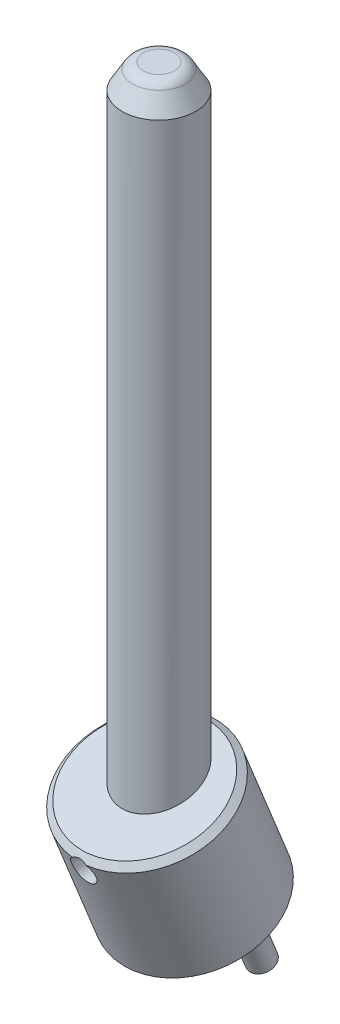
ISO-10303-21;
HEADER;
FILE_DESCRIPTION(('STEP AP214'),'2;1');
FILE_NAME('part.step','',(''),(''),'','','');
FILE_SCHEMA(('AUTOMOTIVE_DESIGN { 1 0 10303 214 1 1 1 1 }'));
ENDSEC;
DATA;
#1=APPLICATION_CONTEXT('core data for automotive mechanical design processes');
#2=APPLICATION_PROTOCOL_DEFINITION('international standard','automotive_design',2000,#1);
#3=PRODUCT_CONTEXT('',#1,'mechanical');
#4=PRODUCT('Part','Part','',(#3));
#5=PRODUCT_RELATED_PRODUCT_CATEGORY('part','',(#4));
#6=PRODUCT_DEFINITION_FORMATION('','',#4);
#7=PRODUCT_DEFINITION_CONTEXT('part definition',#1,'design');
#8=PRODUCT_DEFINITION('design','',#6,#7);
#9=PRODUCT_DEFINITION_SHAPE('','',#8);
#10=(LENGTH_UNIT() NAMED_UNIT(*) SI_UNIT(.MILLI.,.METRE.));
#11=(NAMED_UNIT(*) PLANE_ANGLE_UNIT() SI_UNIT($,.RADIAN.));
#12=(NAMED_UNIT(*) SI_UNIT($,.STERADIAN.) SOLID_ANGLE_UNIT());
#13=UNCERTAINTY_MEASURE_WITH_UNIT(LENGTH_MEASURE(1.E-05),#10,'distance_accuracy_value','');
#14=(GEOMETRIC_REPRESENTATION_CONTEXT(3) GLOBAL_UNCERTAINTY_ASSIGNED_CONTEXT((#13)) GLOBAL_UNIT_ASSIGNED_CONTEXT((#10,
#11,#12)) REPRESENTATION_CONTEXT('',''));
#15=CARTESIAN_POINT('',(0.,0.,0.));
#16=DIRECTION('',(0.,0.,1.));
#17=DIRECTION('',(1.,0.,0.));
#18=AXIS2_PLACEMENT_3D('',#15,#16,#17);
#19=CARTESIAN_POINT('',(0.,118.,0.));
#20=DIRECTION('',(0.,1.,0.));
#21=DIRECTION('',(-1.,0.,0.));
#22=AXIS2_PLACEMENT_3D('',#19,#20,#21);
#23=PLANE('',#22);
#24=CARTESIAN_POINT('',(0.,118.,-2.535898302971));
#25=CARTESIAN_POINT('',(0.0368831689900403,118.,-2.53589885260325));
#26=CARTESIAN_POINT('',(0.0737662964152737,118.,-2.53509365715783));
#27=CARTESIAN_POINT('',(0.147462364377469,118.,-2.53187572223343));
#28=CARTESIAN_POINT('',(0.18427530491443,118.,-2.52946298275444));
#29=CARTESIAN_POINT('',(0.25776089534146,118.,-2.52303390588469));
#30=CARTESIAN_POINT('',(0.294433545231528,118.,-2.51901756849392));
#31=CARTESIAN_POINT('',(0.367568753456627,118.,-2.50938911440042));
#32=CARTESIAN_POINT('',(0.404031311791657,118.,-2.50377699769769));
#33=CARTESIAN_POINT('',(0.47667692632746,118.,-2.490967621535));
#34=CARTESIAN_POINT('',(0.512859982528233,118.,-2.48377036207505));
#35=CARTESIAN_POINT('',(0.584877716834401,118.,-2.46780441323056));
#36=CARTESIAN_POINT('',(0.620712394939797,118.,-2.45903572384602));
#37=CARTESIAN_POINT('',(0.691965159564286,118.,-2.4399436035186));
#38=CARTESIAN_POINT('',(0.727383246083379,118.,-2.42962017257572));
#39=CARTESIAN_POINT('',(0.797735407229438,118.,-2.4074382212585));
#40=CARTESIAN_POINT('',(0.832669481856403,118.,-2.39557970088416));
#41=CARTESIAN_POINT('',(0.901987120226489,118.,-2.37035014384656));
#42=CARTESIAN_POINT('',(0.93637068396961,118.,-2.35697910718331));
#43=CARTESIAN_POINT('',(1.00452184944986,118.,-2.32874997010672));
#44=CARTESIAN_POINT('',(1.03828945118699,118.,-2.31389186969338));
#45=CARTESIAN_POINT('',(1.10514441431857,118.,-2.28271688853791));
#46=CARTESIAN_POINT('',(1.13823177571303,118.,-2.26640000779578));
#47=CARTESIAN_POINT('',(1.20366327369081,118.,-2.23233852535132));
#48=CARTESIAN_POINT('',(1.23600741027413,118.,-2.21459392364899));
#49=CARTESIAN_POINT('',(1.29989089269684,118.,-2.17771077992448));
#50=CARTESIAN_POINT('',(1.33143023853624,118.,-2.1585722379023));
#51=CARTESIAN_POINT('',(1.39364409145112,118.,-2.11893763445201));
#52=CARTESIAN_POINT('',(1.4243185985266,118.,-2.0984415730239));
#53=CARTESIAN_POINT('',(1.48474442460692,118.,-2.05613098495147));
#54=CARTESIAN_POINT('',(1.51449574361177,118.,-2.03431645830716));
#55=CARTESIAN_POINT('',(1.57301840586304,118.,-1.98941032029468));
#56=CARTESIAN_POINT('',(1.60178974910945,117.999999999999,-1.96631870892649));
#57=CARTESIAN_POINT('',(1.65829826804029,118.000000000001,-1.91890289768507));
#58=CARTESIAN_POINT('',(1.68603544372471,118.000000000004,-1.89457869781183));
#59=CARTESIAN_POINT('',(1.74042067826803,117.999999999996,-1.84474199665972));
#60=CARTESIAN_POINT('',(1.76706873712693,117.999999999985,-1.81922949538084));
#61=CARTESIAN_POINT('',(1.82029256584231,118.000000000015,-1.76601289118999));
#62=CARTESIAN_POINT('',(1.84682142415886,118.000000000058,-1.73826186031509));
#63=CARTESIAN_POINT('',(1.89860821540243,117.999999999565,-1.68159728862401));
#64=CARTESIAN_POINT('',(1.92386612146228,117.999999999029,-1.65268372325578));
#65=CARTESIAN_POINT('',(1.97305870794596,117.999999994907,-1.59375026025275));
#66=CARTESIAN_POINT('',(1.99699333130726,117.999999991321,-1.56373031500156));
#67=CARTESIAN_POINT('',(2.04349107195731,117.999999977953,-1.50264173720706));
#68=CARTESIAN_POINT('',(2.06605409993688,117.999999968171,-1.47157303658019));
#69=CARTESIAN_POINT('',(2.09883857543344,117.999999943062,-1.42423762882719));
#70=CARTESIAN_POINT('',(2.10959069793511,117.999999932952,-1.40833607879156));
#71=CARTESIAN_POINT('',(2.13071680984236,117.999999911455,-1.37630625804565));
#72=CARTESIAN_POINT('',(2.14109116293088,117.99999990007,-1.36017822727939));
#73=CARTESIAN_POINT('',(2.17164317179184,117.999999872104,-1.31143484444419));
#74=CARTESIAN_POINT('',(2.19125045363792,117.999999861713,-1.27845922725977));
#75=CARTESIAN_POINT('',(2.22889471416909,117.99999986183,-1.21162642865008));
#76=CARTESIAN_POINT('',(2.24693169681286,117.999999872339,-1.17776924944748));
#77=CARTESIAN_POINT('',(2.28142652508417,117.999999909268,-1.10926021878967));
#78=CARTESIAN_POINT('',(2.2978844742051,117.999999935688,-1.07460841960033));
#79=CARTESIAN_POINT('',(2.32906359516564,117.999999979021,-1.00453892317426));
#80=CARTESIAN_POINT('',(2.343784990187,117.999999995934,-0.969121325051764));
#81=CARTESIAN_POINT('',(2.36475645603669,118.000000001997,-0.915929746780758));
#82=CARTESIAN_POINT('',(2.37150562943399,118.000000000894,-0.898347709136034));
#83=CARTESIAN_POINT('',(2.39938010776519,117.999999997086,-0.823272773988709));
#84=CARTESIAN_POINT('',(2.41865194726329,117.999999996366,-0.765068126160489));
#85=CARTESIAN_POINT('',(2.44418153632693,117.999999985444,-0.677429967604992));
#86=CARTESIAN_POINT('',(2.4520654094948,117.999999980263,-0.648455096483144));
#87=CARTESIAN_POINT('',(2.4678771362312,117.999999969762,-0.585935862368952));
#88=CARTESIAN_POINT('',(2.47563936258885,117.999999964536,-0.55234891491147));
#89=CARTESIAN_POINT('',(2.48574291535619,117.999999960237,-0.504089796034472));
#90=CARTESIAN_POINT('',(2.48865470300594,117.999999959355,-0.489534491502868));
#91=CARTESIAN_POINT('',(2.49475256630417,117.999999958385,-0.457572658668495));
#92=CARTESIAN_POINT('',(2.49788384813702,117.999999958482,-0.440155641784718));
#93=CARTESIAN_POINT('',(2.50672484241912,117.999999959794,-0.387811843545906));
#94=CARTESIAN_POINT('',(2.51188215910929,117.999999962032,-0.352790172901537));
#95=CARTESIAN_POINT('',(2.52071042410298,117.999999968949,-0.282561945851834));
#96=CARTESIAN_POINT('',(2.52438140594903,117.999999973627,-0.247355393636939));
#97=CARTESIAN_POINT('',(2.53023391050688,117.999999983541,-0.176819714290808));
#98=CARTESIAN_POINT('',(2.53241549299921,117.999999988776,-0.141490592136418));
#99=CARTESIAN_POINT('',(2.53527541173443,117.999999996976,-0.0707738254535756));
#100=CARTESIAN_POINT('',(2.53595383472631,117.999999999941,-0.0353861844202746));
#101=CARTESIAN_POINT('',(2.53584271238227,118.000000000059,0.0354236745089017));
#102=CARTESIAN_POINT('',(2.5350516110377,117.999999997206,0.0708458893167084));
#103=CARTESIAN_POINT('',(2.5320340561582,117.999999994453,0.141627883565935));
#104=CARTESIAN_POINT('',(2.52980764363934,117.999999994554,0.176987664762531));
#105=CARTESIAN_POINT('',(2.52391930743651,117.99999999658,0.2475885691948));
#106=CARTESIAN_POINT('',(2.52025735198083,117.999999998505,0.28282968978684));
#107=CARTESIAN_POINT('',(2.51148466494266,118.000000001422,0.353133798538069));
#108=CARTESIAN_POINT('',(2.50637382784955,118.000000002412,0.388196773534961));
#109=CARTESIAN_POINT('',(2.49768726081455,117.999999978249,0.440622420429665));
#110=CARTESIAN_POINT('',(2.49462143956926,117.999999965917,0.458070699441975));
#111=CARTESIAN_POINT('',(2.48998637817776,117.999999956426,0.482622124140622));
#112=CARTESIAN_POINT('',(2.48860039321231,117.999999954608,0.489759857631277));
#113=CARTESIAN_POINT('',(2.4808778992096,117.999999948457,0.528551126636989));
#114=CARTESIAN_POINT('',(2.47391140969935,117.999999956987,0.56008128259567));
#115=CARTESIAN_POINT('',(2.45703811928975,117.999999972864,0.630094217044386));
#116=CARTESIAN_POINT('',(2.44682378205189,117.999999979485,0.668502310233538));
#117=CARTESIAN_POINT('',(2.42009299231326,117.999999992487,0.760237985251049));
#118=CARTESIAN_POINT('',(2.40269884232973,117.999999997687,0.81331421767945));
#119=CARTESIAN_POINT('',(2.3753299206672,117.999999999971,0.888439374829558));
#120=CARTESIAN_POINT('',(2.36674512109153,117.999999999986,0.911006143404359));
#121=CARTESIAN_POINT('',(2.34370619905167,118.000000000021,0.969129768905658));
#122=CARTESIAN_POINT('',(2.32877604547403,118.000000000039,1.00450008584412));
#123=CARTESIAN_POINT('',(2.29733862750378,117.999999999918,1.0745319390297));
#124=CARTESIAN_POINT('',(2.2808313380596,117.999999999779,1.10919346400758));
#125=CARTESIAN_POINT('',(2.24628151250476,117.999999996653,1.17774451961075));
#126=CARTESIAN_POINT('',(2.22823891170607,117.999999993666,1.2116340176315));
#127=CARTESIAN_POINT('',(2.19064875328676,117.999999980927,1.27857233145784));
#128=CARTESIAN_POINT('',(2.1711010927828,117.999999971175,1.31162108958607));
#129=CARTESIAN_POINT('',(2.14068914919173,117.999999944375,1.36051430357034));
#130=CARTESIAN_POINT('',(2.13036938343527,117.999999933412,1.37669975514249));
#131=CARTESIAN_POINT('',(2.10937145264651,117.999999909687,1.40881381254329));
#132=CARTESIAN_POINT('',(2.09869365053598,117.999999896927,1.42474265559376));
#133=CARTESIAN_POINT('',(2.06610220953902,117.999999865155,1.4721471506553));
#134=CARTESIAN_POINT('',(2.04362999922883,117.999999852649,1.50324163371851));
#135=CARTESIAN_POINT('',(1.99724968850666,117.999999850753,1.56433741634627));
#136=CARTESIAN_POINT('',(1.9733415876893,117.999999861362,1.59433871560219));
#137=CARTESIAN_POINT('',(1.92416676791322,117.999999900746,1.65320597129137));
#138=CARTESIAN_POINT('',(1.89890013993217,117.99999992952,1.68207200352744));
#139=CARTESIAN_POINT('',(1.846969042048,117.999999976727,1.73850865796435));
#140=CARTESIAN_POINT('',(1.82030475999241,117.999999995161,1.76607945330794));
#141=CARTESIAN_POINT('',(1.77844405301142,118.000000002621,1.80781306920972));
#142=CARTESIAN_POINT('',(1.76359360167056,118.000000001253,1.82232876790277));
#143=CARTESIAN_POINT('',(1.70076531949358,117.999999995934,1.88227042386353));
#144=CARTESIAN_POINT('',(1.65118456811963,117.999999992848,1.92605591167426));
#145=CARTESIAN_POINT('',(1.57488305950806,117.999999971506,1.98829577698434));
#146=CARTESIAN_POINT('',(1.549391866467,117.999999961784,2.00828584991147));
#147=CARTESIAN_POINT('',(1.49369878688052,117.999999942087,2.0502411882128));
#148=CARTESIAN_POINT('',(1.46337191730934,117.999999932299,2.0720420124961));
#149=CARTESIAN_POINT('',(1.41924056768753,117.999999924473,2.10228129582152));
#150=CARTESIAN_POINT('',(1.40582015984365,117.99999992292,2.11128589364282));
#151=CARTESIAN_POINT('',(1.37628726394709,117.999999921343,2.13068691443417));
#152=CARTESIAN_POINT('',(1.36013949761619,117.999999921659,2.14102971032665));
#153=CARTESIAN_POINT('',(1.31134785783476,117.999999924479,2.1714986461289));
#154=CARTESIAN_POINT('',(1.27835328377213,117.999999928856,2.19106696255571));
#155=CARTESIAN_POINT('',(1.21150291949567,117.999999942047,2.22866697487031));
#156=CARTESIAN_POINT('',(1.17764715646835,117.999999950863,2.2466987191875));
#157=CARTESIAN_POINT('',(1.10914688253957,117.999999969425,2.28119222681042));
#158=CARTESIAN_POINT('',(1.07450241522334,117.999999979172,2.29765407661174));
#159=CARTESIAN_POINT('',(1.00449363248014,117.999999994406,2.3289604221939));
#160=CARTESIAN_POINT('',(0.969129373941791,117.999999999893,2.34380504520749));
#161=CARTESIAN_POINT('',(0.900489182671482,118.000000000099,2.37082263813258));
#162=CARTESIAN_POINT('',(0.867259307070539,117.999999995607,2.38311297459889));
#163=CARTESIAN_POINT('',(0.800333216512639,117.999999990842,2.40634607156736));
#164=CARTESIAN_POINT('',(0.766637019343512,117.99999999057,2.41728888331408));
#165=CARTESIAN_POINT('',(0.698829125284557,117.999999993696,2.43780460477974));
#166=CARTESIAN_POINT('',(0.664717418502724,117.999999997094,2.44737748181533));
#167=CARTESIAN_POINT('',(0.596126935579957,118.00000000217,2.46511836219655));
#168=CARTESIAN_POINT('',(0.561648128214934,118.000000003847,2.47328624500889));
#169=CARTESIAN_POINT('',(0.515953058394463,117.999999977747,2.48318600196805));
#170=CARTESIAN_POINT('',(0.504864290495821,117.999999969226,2.48551693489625));
#171=CARTESIAN_POINT('',(0.482616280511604,117.999999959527,2.4899893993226));
#172=CARTESIAN_POINT('',(0.471456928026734,117.999999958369,2.49213038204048));
#173=CARTESIAN_POINT('',(0.423172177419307,117.99999995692,2.50104303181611));
#174=CARTESIAN_POINT('',(0.385898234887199,117.999999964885,2.50702838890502));
#175=CARTESIAN_POINT('',(0.321772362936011,117.999999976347,2.51585848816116));
#176=CARTESIAN_POINT('',(0.294975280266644,117.99999998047,2.51911220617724));
#177=CARTESIAN_POINT('',(0.239190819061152,117.999999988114,2.52498123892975));
#178=CARTESIAN_POINT('',(0.210196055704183,117.999999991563,2.52752671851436));
#179=CARTESIAN_POINT('',(0.14428351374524,117.999999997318,2.53217246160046));
#180=CARTESIAN_POINT('',(0.107343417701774,117.999999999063,2.53396620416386));
#181=CARTESIAN_POINT('',(0.0598216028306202,117.999999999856,2.53524043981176));
#182=CARTESIAN_POINT('',(0.0492560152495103,117.999999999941,2.53545811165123));
#183=CARTESIAN_POINT('',(0.0257940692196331,118.000000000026,2.53580073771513));
#184=CARTESIAN_POINT('',(0.0128972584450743,118.000000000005,2.53589468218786));
#185=CARTESIAN_POINT('',(0.,118.,2.535898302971));
#186=B_SPLINE_CURVE_WITH_KNOTS('',3,(#24,#25,#26,#27,#28,#29,#30,#31,#32,#33,#34,#35,#36,#37,
#38,#39,#40,#41,#42,#43,#44,#45,#46,#47,#48,#49,#50,#51,#52,#53,#54,#55,#56,#57,#58,#59,#60,#61,
#62,#63,#64,#65,#66,#67,#68,#69,#70,#71,#72,#73,#74,#75,#76,#77,#78,#79,#80,#81,#82,#83,#84,#85,
#86,#87,#88,#89,#90,#91,#92,#93,#94,#95,#96,#97,#98,#99,#100,#101,#102,#103,#104,#105,#106,#107,
#108,#109,#110,#111,#112,#113,#114,#115,#116,#117,#118,#119,#120,#121,#122,#123,#124,#125,#126,
#127,#128,#129,#130,#131,#132,#133,#134,#135,#136,#137,#138,#139,#140,#141,#142,#143,#144,#145,
#146,#147,#148,#149,#150,#151,#152,#153,#154,#155,#156,#157,#158,#159,#160,#161,#162,#163,#164,
#165,#166,#167,#168,#169,#170,#171,#172,#173,#174,#175,#176,#177,#178,#179,#180,#181,#182,#183,
#184,#185),.UNSPECIFIED.,.F.,.F.,(4,2,2,2,2,2,2,2,2,2,2,2,2,2,2,2,2,2,2,2,2,2,2,2,2,2,2,2,2,2,2,
2,2,2,2,2,2,2,2,2,2,2,2,2,2,2,2,2,2,2,2,2,2,2,2,2,2,2,2,2,2,2,2,2,2,2,2,2,2,2,2,2,2,2,2,2,2,2,2,
2,4),(0.,0.110640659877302,0.221281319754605,0.331921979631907,0.44256263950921,
0.553203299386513,0.663843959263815,0.774484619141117,0.88512527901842,0.995765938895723,
1.10640659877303,1.21704725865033,1.32768791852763,1.43832857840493,1.54896923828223,
1.65960989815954,1.77025055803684,1.88089121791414,1.99153187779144,2.10666707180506,
2.22180469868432,2.3369472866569,2.45209736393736,2.50967963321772,2.56720491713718,
2.68225192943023,2.7972986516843,2.91233782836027,3.02736220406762,3.08386093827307,
3.2675950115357,3.35766741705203,3.46104880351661,3.50557818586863,3.55866337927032,
3.66482720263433,3.7709886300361,3.87714579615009,3.98329683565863,4.08956033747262,
4.19582080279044,4.30208362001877,4.40835417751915,4.46149679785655,4.48330970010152,
4.58015247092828,4.69934377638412,4.86676228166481,4.93919015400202,5.05432496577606,
5.16946160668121,5.28460310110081,5.39975247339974,5.45733467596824,5.51486017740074,
5.6299081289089,5.7449561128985,5.85999640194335,5.97502126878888,6.03731998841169,
6.23550765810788,6.33267537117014,6.44467915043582,6.49316104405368,6.55068486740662,
6.66572392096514,6.78075934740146,6.89578843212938,7.01080846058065,7.11706929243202,
7.22332608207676,7.32958540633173,7.43585384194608,7.46984614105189,7.5039336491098,
7.61714190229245,7.69811150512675,7.78541397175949,7.89632392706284,7.92802695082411,
7.96671751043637),.UNSPECIFIED.);
#187=CARTESIAN_POINT('',(0.,118.,-2.5358983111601));
#188=VERTEX_POINT('',#187);
#189=CARTESIAN_POINT('',(0.,118.,2.5358983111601));
#190=VERTEX_POINT('',#189);
#191=EDGE_CURVE('P0_E38',#188,#190,#186,.T.);
#192=ORIENTED_EDGE('',*,*,#191,.F.);
#193=CARTESIAN_POINT('',(0.,118.,0.));
#194=DIRECTION('',(0.,-1.,0.));
#195=DIRECTION('',(0.,0.,1.));
#196=AXIS2_PLACEMENT_3D('',#193,#194,#195);
#197=CIRCLE('',#196,2.535898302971);
#198=EDGE_CURVE('P0_E42',#190,#188,#197,.T.);
#199=ORIENTED_EDGE('',*,*,#198,.F.);
#200=EDGE_LOOP('',(#192,#199));
#201=FACE_BOUND('',#200,.T.);
#202=ADVANCED_FACE('P0_F17',(#201),#23,.T.);
#203=CARTESIAN_POINT('',(0.,116.,0.));
#204=DIRECTION('',(0.,1.,0.));
#205=DIRECTION('',(0.0152566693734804,0.,0.999883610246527));
#206=AXIS2_PLACEMENT_3D('',#203,#204,#205);
#207=TOROIDAL_SURFACE('',#206,2.535898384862,2.);
#208=ORIENTED_EDGE('',*,*,#191,.T.);
#209=ORIENTED_EDGE('',*,*,#198,.T.);
#210=EDGE_LOOP('',(#208,#209));
#211=FACE_BOUND('',#210,.T.);
#212=CARTESIAN_POINT('',(0.,117.000000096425,0.));
#213=DIRECTION('',(0.,-1.,0.));
#214=DIRECTION('',(0.,0.,1.));
#215=AXIS2_PLACEMENT_3D('',#212,#213,#214);
#216=CIRCLE('',#215,4.26794913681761);
#217=CARTESIAN_POINT('',(0.,117.000000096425,4.26794913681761));
#218=VERTEX_POINT('',#217);
#219=EDGE_CURVE('P0_E48',#218,#218,#216,.T.);
#220=ORIENTED_EDGE('',*,*,#219,.F.);
#221=EDGE_LOOP('',(#220));
#222=FACE_BOUND('',#221,.T.);
#223=ADVANCED_FACE('P0_F40',(#211,#222),#207,.T.);
#224=CARTESIAN_POINT('',(0.,0.,0.));
#225=DIRECTION('',(0.,1.,0.));
#226=DIRECTION('',(-1.,0.,0.));
#227=AXIS2_PLACEMENT_3D('',#224,#225,#226);
#228=PLANE('',#227);
#229=CARTESIAN_POINT('',(0.,-2.00088834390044E-08,0.));
#230=DIRECTION('',(0.,1.,0.));
#231=DIRECTION('',(-1.,0.,0.));
#232=AXIS2_PLACEMENT_3D('',#229,#230,#231);
#233=CIRCLE('',#232,4.99999913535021);
#234=CARTESIAN_POINT('',(-4.99999913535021,-2.00088834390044E-08,0.));
#235=VERTEX_POINT('',#234);
#236=EDGE_CURVE('P0_E85',#235,#235,#233,.T.);
#237=ORIENTED_EDGE('',*,*,#236,.F.);
#238=EDGE_LOOP('',(#237));
#239=FACE_BOUND('',#238,.T.);
#240=ADVANCED_FACE('P0_F76',(#239),#228,.F.);
#241=CARTESIAN_POINT('',(0.,10.,2.15470053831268));
#242=DIRECTION('',(0.,0.,1.));
#243=DIRECTION('',(0.,-1.,0.));
#244=AXIS2_PLACEMENT_3D('',#241,#242,#243);
#245=CONICAL_SURFACE('',#244,2.00000000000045,1.0471975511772);
#246=CARTESIAN_POINT('',(0.,9.99999999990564,0.99999999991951));
#247=VERTEX_POINT('',#246);
#248=VERTEX_LOOP('',#247);
#249=FACE_BOUND('',#248,.T.);
#250=CARTESIAN_POINT('',(0.,10.,2.154700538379));
#251=DIRECTION('',(0.,0.,1.));
#252=DIRECTION('',(0.,-1.,0.));
#253=AXIS2_PLACEMENT_3D('',#250,#251,#252);
#254=CIRCLE('',#253,2.);
#255=CARTESIAN_POINT('',(0.,8.,2.154700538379));
#256=VERTEX_POINT('',#255);
#257=EDGE_CURVE('P0_E82',#256,#256,#254,.T.);
#258=ORIENTED_EDGE('',*,*,#257,.T.);
#259=EDGE_LOOP('',(#258));
#260=FACE_BOUND('',#259,.T.);
#261=ADVANCED_FACE('P0_F116',(#249,#260),#245,.F.);
#262=CARTESIAN_POINT('',(0.,114.00000000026,0.));
#263=DIRECTION('',(0.,-1.,0.));
#264=DIRECTION('',(1.,0.,0.));
#265=AXIS2_PLACEMENT_3D('',#262,#263,#264);
#266=CONICAL_SURFACE('',#265,5.99999999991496,0.523598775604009);
#267=CARTESIAN_POINT('',(0.,114.,0.));
#268=DIRECTION('',(0.,1.,0.));
#269=DIRECTION('',(-1.,0.,0.));
#270=AXIS2_PLACEMENT_3D('',#267,#268,#269);
#271=CIRCLE('',#270,6.);
#272=CARTESIAN_POINT('',(-6.,114.,0.));
#273=VERTEX_POINT('',#272);
#274=EDGE_CURVE('P0_E92',#273,#273,#271,.F.);
#275=ORIENTED_EDGE('',*,*,#274,.F.);
#276=EDGE_LOOP('',(#275));
#277=FACE_BOUND('',#276,.T.);
#278=ORIENTED_EDGE('',*,*,#219,.T.);
#279=EDGE_LOOP('',(#278));
#280=FACE_BOUND('',#279,.T.);
#281=ADVANCED_FACE('P0_F108',(#277,#280),#266,.T.);
#282=CARTESIAN_POINT('',(0.,1.00000103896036,0.));
#283=DIRECTION('',(0.,1.,0.));
#284=DIRECTION('',(-1.,0.,0.));
#285=AXIS2_PLACEMENT_3D('',#282,#283,#284);
#286=CONICAL_SURFACE('',#285,6.00000002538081,0.78539807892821);
#287=CARTESIAN_POINT('',(0.,1.000001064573,0.));
#288=DIRECTION('',(0.,1.,0.));
#289=DIRECTION('',(-1.,0.,0.));
#290=AXIS2_PLACEMENT_3D('',#287,#288,#289);
#291=CIRCLE('',#290,6.);
#292=CARTESIAN_POINT('',(-6.,1.000001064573,0.));
#293=VERTEX_POINT('',#292);
#294=EDGE_CURVE('P0_E28',#293,#293,#291,.T.);
#295=ORIENTED_EDGE('',*,*,#294,.F.);
#296=EDGE_LOOP('',(#295));
#297=FACE_BOUND('',#296,.T.);
#298=ORIENTED_EDGE('',*,*,#236,.T.);
#299=EDGE_LOOP('',(#298));
#300=FACE_BOUND('',#299,.T.);
#301=ADVANCED_FACE('P0_F105',(#297,#300),#286,.T.);
#302=CARTESIAN_POINT('',(0.,10.,0.65));
#303=DIRECTION('',(0.,0.,1.));
#304=DIRECTION('',(0.,-1.,0.));
#305=AXIS2_PLACEMENT_3D('',#302,#303,#304);
#306=CYLINDRICAL_SURFACE('',#305,2.);
#307=ORIENTED_EDGE('',*,*,#257,.F.);
#308=EDGE_LOOP('',(#307));
#309=FACE_BOUND('',#308,.T.);
#310=CARTESIAN_POINT('',(0.,8.,6.));
#311=CARTESIAN_POINT('',(-0.108974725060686,8.00000612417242,5.99999564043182));
#312=CARTESIAN_POINT('',(-0.218061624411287,8.00894817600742,5.9969989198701));
#313=CARTESIAN_POINT('',(-0.433135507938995,8.04441497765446,5.98531898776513));
#314=CARTESIAN_POINT('',(-0.539117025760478,8.07096899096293,5.97662631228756));
#315=CARTESIAN_POINT('',(-0.744677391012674,8.14064454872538,5.9545040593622));
#316=CARTESIAN_POINT('',(-0.844270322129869,8.18372807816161,5.94108535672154));
#317=CARTESIAN_POINT('',(-1.03478027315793,8.2851008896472,5.91088362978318));
#318=CARTESIAN_POINT('',(-1.12569835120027,8.34338831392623,5.8941010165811));
#319=CARTESIAN_POINT('',(-1.29948066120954,8.475649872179,5.8582823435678));
#320=CARTESIAN_POINT('',(-1.3820029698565,8.55005856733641,5.83919212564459));
#321=CARTESIAN_POINT('',(-1.53366185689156,8.71152973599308,5.80120729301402));
#322=CARTESIAN_POINT('',(-1.60279478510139,8.79859564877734,5.78231273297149));
#323=CARTESIAN_POINT('',(-1.72765000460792,8.98597045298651,5.7462666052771));
#324=CARTESIAN_POINT('',(-1.78292996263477,9.08658794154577,5.72918070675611));
#325=CARTESIAN_POINT('',(-1.87563792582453,9.2963526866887,5.69950605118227));
#326=CARTESIAN_POINT('',(-1.91307145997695,9.40549728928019,5.68691590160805));
#327=CARTESIAN_POINT('',(-1.96774691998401,9.62534643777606,5.66822606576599));
#328=CARTESIAN_POINT('',(-1.98562689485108,9.73587440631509,5.66192191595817));
#329=CARTESIAN_POINT('',(-2.00268224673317,9.95852749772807,5.65591313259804));
#330=CARTESIAN_POINT('',(-2.00186340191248,10.0706521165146,5.65620646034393));
#331=CARTESIAN_POINT('',(-1.98203983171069,10.2878730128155,5.66318029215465));
#332=CARTESIAN_POINT('',(-1.96386791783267,10.393056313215,5.66956828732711));
#333=CARTESIAN_POINT('',(-1.9112124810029,10.5987863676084,5.68753310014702));
#334=CARTESIAN_POINT('',(-1.87672692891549,10.699332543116,5.69911056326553));
#335=CARTESIAN_POINT('',(-1.79187699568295,10.8948281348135,5.72635859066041));
#336=CARTESIAN_POINT('',(-1.74126547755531,10.9896611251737,5.74209216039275));
#337=CARTESIAN_POINT('',(-1.62577463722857,11.1697464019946,5.77585213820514));
#338=CARTESIAN_POINT('',(-1.56089195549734,11.2549964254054,5.79387908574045));
#339=CARTESIAN_POINT('',(-1.41471183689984,11.4181688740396,5.83134330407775));
#340=CARTESIAN_POINT('',(-1.33273573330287,11.4954788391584,5.85080514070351));
#341=CARTESIAN_POINT('',(-1.15670996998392,11.6354411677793,5.88813263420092));
#342=CARTESIAN_POINT('',(-1.06265504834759,11.6980871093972,5.90599758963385));
#343=CARTESIAN_POINT('',(-0.86381483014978,11.8074392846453,5.93835612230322));
#344=CARTESIAN_POINT('',(-0.75892625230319,11.8539693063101,5.95281190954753));
#345=CARTESIAN_POINT('',(-0.542326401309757,11.9284560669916,5.97642703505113));
#346=CARTESIAN_POINT('',(-0.430629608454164,11.9564508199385,5.98559720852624));
#347=CARTESIAN_POINT('',(-0.264915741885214,11.9830911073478,5.99438078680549));
#348=CARTESIAN_POINT('',(-0.212162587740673,11.9894240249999,5.99648164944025));
#349=CARTESIAN_POINT('',(-0.106281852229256,11.9978799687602,5.99929232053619));
#350=CARTESIAN_POINT('',(-0.0531542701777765,12.000002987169,6.00000212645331));
#351=CARTESIAN_POINT('',(0.108974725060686,11.9999938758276,5.99999564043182));
#352=CARTESIAN_POINT('',(0.218061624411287,11.9910518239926,5.9969989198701));
#353=CARTESIAN_POINT('',(0.433135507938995,11.9555850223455,5.98531898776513));
#354=CARTESIAN_POINT('',(0.539117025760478,11.9290310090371,5.97662631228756));
#355=CARTESIAN_POINT('',(0.744677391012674,11.8593554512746,5.9545040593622));
#356=CARTESIAN_POINT('',(0.844270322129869,11.8162719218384,5.94108535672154));
#357=CARTESIAN_POINT('',(1.03478027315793,11.7148991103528,5.91088362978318));
#358=CARTESIAN_POINT('',(1.12569835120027,11.6566116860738,5.8941010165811));
#359=CARTESIAN_POINT('',(1.29948066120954,11.524350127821,5.8582823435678));
#360=CARTESIAN_POINT('',(1.3820029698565,11.4499414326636,5.83919212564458));
#361=CARTESIAN_POINT('',(1.53366185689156,11.2884702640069,5.80120729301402));
#362=CARTESIAN_POINT('',(1.60279478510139,11.2014043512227,5.78231273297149));
#363=CARTESIAN_POINT('',(1.72765000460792,11.0140295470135,5.7462666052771));
#364=CARTESIAN_POINT('',(1.78292996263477,10.9134120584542,5.72918070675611));
#365=CARTESIAN_POINT('',(1.87563792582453,10.7036473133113,5.69950605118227));
#366=CARTESIAN_POINT('',(1.91307145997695,10.5945027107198,5.68691590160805));
#367=CARTESIAN_POINT('',(1.96774691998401,10.3746535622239,5.66822606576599));
#368=CARTESIAN_POINT('',(1.98562689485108,10.2641255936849,5.66192191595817));
#369=CARTESIAN_POINT('',(2.00268224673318,10.0414725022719,5.65591313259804));
#370=CARTESIAN_POINT('',(2.00186340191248,9.92934788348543,5.65620646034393));
#371=CARTESIAN_POINT('',(1.98203983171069,9.71212698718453,5.66318029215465));
#372=CARTESIAN_POINT('',(1.96386791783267,9.60694368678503,5.66956828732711));
#373=CARTESIAN_POINT('',(1.9112124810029,9.40121363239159,5.68753310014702));
#374=CARTESIAN_POINT('',(1.87672692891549,9.30066745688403,5.69911056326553));
#375=CARTESIAN_POINT('',(1.79187699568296,9.10517186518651,5.72635859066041));
#376=CARTESIAN_POINT('',(1.74126547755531,9.01033887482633,5.74209216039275));
#377=CARTESIAN_POINT('',(1.62577463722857,8.83025359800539,5.77585213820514));
#378=CARTESIAN_POINT('',(1.56089195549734,8.74500357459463,5.79387908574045));
#379=CARTESIAN_POINT('',(1.41471183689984,8.58183112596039,5.83134330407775));
#380=CARTESIAN_POINT('',(1.33273573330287,8.50452116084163,5.85080514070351));
#381=CARTESIAN_POINT('',(1.15670996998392,8.36455883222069,5.88813263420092));
#382=CARTESIAN_POINT('',(1.06265504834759,8.30191289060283,5.90599758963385));
#383=CARTESIAN_POINT('',(0.86381483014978,8.19256071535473,5.93835612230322));
#384=CARTESIAN_POINT('',(0.75892625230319,8.14603069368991,5.95281190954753));
#385=CARTESIAN_POINT('',(0.542326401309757,8.07154393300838,5.97642703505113));
#386=CARTESIAN_POINT('',(0.430629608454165,8.04354918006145,5.98559720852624));
#387=CARTESIAN_POINT('',(0.264915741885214,8.01690889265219,5.99438078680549));
#388=CARTESIAN_POINT('',(0.212162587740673,8.01057597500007,5.99648164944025));
#389=CARTESIAN_POINT('',(0.106281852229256,8.00212003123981,5.99929232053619));
#390=CARTESIAN_POINT('',(0.0531542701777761,7.99999701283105,6.00000212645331));
#391=CARTESIAN_POINT('',(0.,8.,6.));
#392=B_SPLINE_CURVE_WITH_KNOTS('',3,(#310,#311,#312,#313,#314,#315,#316,#317,#318,#319,#320,
#321,#322,#323,#324,#325,#326,#327,#328,#329,#330,#331,#332,#333,#334,#335,#336,#337,#338,#339,
#340,#341,#342,#343,#344,#345,#346,#347,#348,#349,#350,#351,#352,#353,#354,#355,#356,#357,#358,
#359,#360,#361,#362,#363,#364,#365,#366,#367,#368,#369,#370,#371,#372,#373,#374,#375,#376,#377,
#378,#379,#380,#381,#382,#383,#384,#385,#386,#387,#388,#389,#390,#391),.UNSPECIFIED.,.T.,.F.,(4,
2,2,2,2,2,2,2,2,2,2,2,2,2,2,2,2,2,2,2,2,2,2,2,2,2,2,2,2,2,2,2,2,2,2,2,2,2,2,2,4),(0.,
0.32671907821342,0.653982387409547,0.980497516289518,1.30697276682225,1.64368488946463,
1.98048867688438,2.32696849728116,2.67334090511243,3.00803851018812,3.34263269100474,
3.6619357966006,3.98127862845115,4.30577211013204,4.63034206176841,4.97180786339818,
5.31342292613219,5.65866330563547,6.00319342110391,6.16255590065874,6.32191867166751,
6.64863774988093,6.97590105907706,7.30241618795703,7.62889143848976,7.96560356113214,
8.30240734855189,8.64888716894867,8.99525957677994,9.32995718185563,9.66455136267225,
9.98385446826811,10.3031973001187,10.6276907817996,10.9522607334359,11.2937265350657,
11.6353415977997,11.980581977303,12.3251120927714,12.4844745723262,12.643837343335),.UNSPECIFIED.);
#393=CARTESIAN_POINT('',(0.,8.,6.));
#394=VERTEX_POINT('',#393);
#395=EDGE_CURVE('P0_E11',#394,#394,#392,.T.);
#396=ORIENTED_EDGE('',*,*,#395,.F.);
#397=EDGE_LOOP('',(#396));
#398=FACE_BOUND('',#397,.T.);
#399=ADVANCED_FACE('P0_F107',(#309,#398),#306,.F.);
#400=CARTESIAN_POINT('',(0.,-5.9,0.));
#401=DIRECTION('',(0.,1.,0.));
#402=DIRECTION('',(-1.,0.,0.));
#403=AXIS2_PLACEMENT_3D('',#400,#401,#402);
#404=CYLINDRICAL_SURFACE('',#403,6.);
#405=ORIENTED_EDGE('',*,*,#274,.T.);
#406=EDGE_LOOP('',(#405));
#407=FACE_BOUND('',#406,.T.);
#408=ORIENTED_EDGE('',*,*,#294,.T.);
#409=EDGE_LOOP('',(#408));
#410=FACE_BOUND('',#409,.T.);
#411=ORIENTED_EDGE('',*,*,#395,.T.);
#412=EDGE_LOOP('',(#411));
#413=FACE_BOUND('',#412,.T.);
#414=ADVANCED_FACE('P0_F102',(#407,#410,#413),#404,.T.);
#415=CLOSED_SHELL('',(#202,#223,#240,#261,#281,#301,#399,#414));
#416=MANIFOLD_SOLID_BREP('P0_B1',#415);
#417=CARTESIAN_POINT('',(0.,-8.89766441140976,-8.17102497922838));
#418=DIRECTION('',(0.,-0.927183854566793,-0.374606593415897));
#419=DIRECTION('',(0.,0.374606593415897,-0.927183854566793));
#420=AXIS2_PLACEMENT_3D('',#417,#418,#419);
#421=PLANE('',#420);
#422=CARTESIAN_POINT('',(-8.75,-8.89766441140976,-8.17102497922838));
#423=DIRECTION('',(0.,-0.927183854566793,-0.374606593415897));
#424=DIRECTION('',(0.,0.374606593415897,-0.927183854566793));
#425=AXIS2_PLACEMENT_3D('',#422,#423,#424);
#426=CIRCLE('',#425,1.49996275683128);
#427=CARTESIAN_POINT('',(-8.75,-8.33576847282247,-9.56176622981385));
#428=VERTEX_POINT('',#427);
#429=EDGE_CURVE('P1_E19',#428,#428,#426,.F.);
#430=ORIENTED_EDGE('',*,*,#429,.F.);
#431=EDGE_LOOP('',(#430));
#432=FACE_BOUND('',#431,.T.);
#433=ADVANCED_FACE('P1_F16',(#432),#421,.T.);
#434=CARTESIAN_POINT('',(0.,-8.89766441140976,-8.17102497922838));
#435=DIRECTION('',(0.,-0.927183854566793,-0.374606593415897));
#436=DIRECTION('',(0.,0.374606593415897,-0.927183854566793));
#437=AXIS2_PLACEMENT_3D('',#434,#435,#436);
#438=PLANE('',#437);
#439=CARTESIAN_POINT('',(8.75,-8.89766441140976,-8.17102497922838));
#440=DIRECTION('',(0.,-0.927183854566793,-0.374606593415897));
#441=DIRECTION('',(0.,0.374606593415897,-0.927183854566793));
#442=AXIS2_PLACEMENT_3D('',#439,#440,#441);
#443=CIRCLE('',#442,1.49996275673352);
#444=CARTESIAN_POINT('',(8.75,-8.3357684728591,-9.5617662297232));
#445=VERTEX_POINT('',#444);
#446=EDGE_CURVE('P1_E129',#445,#445,#443,.F.);
#447=ORIENTED_EDGE('',*,*,#446,.F.);
#448=EDGE_LOOP('',(#447));
#449=FACE_BOUND('',#448,.T.);
#450=ADVANCED_FACE('P1_F119',(#449),#438,.T.);
#451=CARTESIAN_POINT('',(0.,5.13478148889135E-13,-2.78423117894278E-13));
#452=DIRECTION('',(0.,-1.,0.));
#453=DIRECTION('',(0.,0.,-1.));
#454=AXIS2_PLACEMENT_3D('',#451,#452,#453);
#455=PLANE('',#454);
#456=CARTESIAN_POINT('',(0.,-3.45209971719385E-13,-1.24466409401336E-12));
#457=DIRECTION('',(0.,-1.,0.));
#458=DIRECTION('',(0.,0.,-1.));
#459=AXIS2_PLACEMENT_3D('',#456,#457,#458);
#460=CIRCLE('',#459,6.);
#461=CARTESIAN_POINT('',(0.,-3.45209971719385E-13,-6.00000000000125));
#462=VERTEX_POINT('',#461);
#463=EDGE_CURVE('P1_E131',#462,#462,#460,.F.);
#464=ORIENTED_EDGE('',*,*,#463,.T.);
#465=EDGE_LOOP('',(#464));
#466=FACE_BOUND('',#465,.T.);
#467=ADVANCED_FACE('P1_F116',(#466),#455,.F.);
#468=CARTESIAN_POINT('',(-8.75,-8.4340462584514,-7.98371108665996));
#469=DIRECTION('',(0.,0.927183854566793,0.374606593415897));
#470=DIRECTION('',(0.,-0.374606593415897,0.927183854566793));
#471=AXIS2_PLACEMENT_3D('',#468,#469,#470);
#472=CONICAL_SURFACE('',#471,1.99997862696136,0.785385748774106);
#473=CARTESIAN_POINT('',(-8.75,-8.43402644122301,-7.98370307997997));
#474=DIRECTION('',(0.,0.927183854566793,0.374606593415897));
#475=DIRECTION('',(0.,-0.374606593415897,0.927183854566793));
#476=AXIS2_PLACEMENT_3D('',#473,#474,#475);
#477=CIRCLE('',#476,2.);
#478=CARTESIAN_POINT('',(-8.75,-9.18323962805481,-6.12933537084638));
#479=VERTEX_POINT('',#478);
#480=EDGE_CURVE('P1_E133',#479,#479,#477,.T.);
#481=ORIENTED_EDGE('',*,*,#480,.F.);
#482=EDGE_LOOP('',(#481));
#483=FACE_BOUND('',#482,.T.);
#484=ORIENTED_EDGE('',*,*,#429,.T.);
#485=EDGE_LOOP('',(#484));
#486=FACE_BOUND('',#485,.T.);
#487=ADVANCED_FACE('P1_F112',(#483,#486),#472,.T.);
#488=CARTESIAN_POINT('',(8.75,-8.43404625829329,-7.98371108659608));
#489=DIRECTION('',(0.,0.927183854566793,0.374606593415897));
#490=DIRECTION('',(0.,-0.374606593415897,0.927183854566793));
#491=AXIS2_PLACEMENT_3D('',#488,#489,#490);
#492=CONICAL_SURFACE('',#491,1.99997862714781,0.785385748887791);
#493=CARTESIAN_POINT('',(8.75,-8.43402644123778,-7.98370307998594));
#494=DIRECTION('',(0.,0.927183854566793,0.374606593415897));
#495=DIRECTION('',(0.,-0.374606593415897,0.927183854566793));
#496=AXIS2_PLACEMENT_3D('',#493,#494,#495);
#497=CIRCLE('',#496,2.);
#498=CARTESIAN_POINT('',(8.75,-9.18323962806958,-6.12933537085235));
#499=VERTEX_POINT('',#498);
#500=EDGE_CURVE('P1_E139',#499,#499,#497,.T.);
#501=ORIENTED_EDGE('',*,*,#500,.F.);
#502=EDGE_LOOP('',(#501));
#503=FACE_BOUND('',#502,.T.);
#504=ORIENTED_EDGE('',*,*,#446,.T.);
#505=EDGE_LOOP('',(#504));
#506=FACE_BOUND('',#505,.T.);
#507=ADVANCED_FACE('P1_F107',(#503,#506),#492,.T.);
#508=CARTESIAN_POINT('',(0.,26.4423726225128,-1.24553145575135E-12));
#509=DIRECTION('',(0.,-1.,0.));
#510=DIRECTION('',(0.,0.,-1.));
#511=AXIS2_PLACEMENT_3D('',#508,#509,#510);
#512=CYLINDRICAL_SURFACE('',#511,6.);
#513=CARTESIAN_POINT('',(0.,18.0000000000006,-1.24639881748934E-12));
#514=DIRECTION('',(0.,0.927183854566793,0.374606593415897));
#515=DIRECTION('',(0.,-0.374606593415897,0.927183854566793));
#516=AXIS2_PLACEMENT_3D('',#513,#514,#515);
#517=ELLIPSE('',#516,6.47120845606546,6.);
#518=CARTESIAN_POINT('',(0.,15.5758426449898,5.99999999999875));
#519=VERTEX_POINT('',#518);
#520=EDGE_CURVE('P1_E43',#519,#519,#517,.F.);
#521=ORIENTED_EDGE('',*,*,#520,.F.);
#522=EDGE_LOOP('',(#521));
#523=FACE_BOUND('',#522,.T.);
#524=ORIENTED_EDGE('',*,*,#463,.F.);
#525=EDGE_LOOP('',(#524));
#526=FACE_BOUND('',#525,.T.);
#527=CARTESIAN_POINT('',(0.,12.0000000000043,5.99999999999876));
#528=CARTESIAN_POINT('',(-0.108974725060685,11.9999938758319,5.99999564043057));
#529=CARTESIAN_POINT('',(-0.218061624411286,11.9910518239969,5.99699891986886));
#530=CARTESIAN_POINT('',(-0.433135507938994,11.9555850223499,5.98531898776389));
#531=CARTESIAN_POINT('',(-0.539117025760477,11.9290310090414,5.97662631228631));
#532=CARTESIAN_POINT('',(-0.744677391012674,11.859355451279,5.95450405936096));
#533=CARTESIAN_POINT('',(-0.844270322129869,11.8162719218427,5.9410853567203));
#534=CARTESIAN_POINT('',(-1.03478027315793,11.7148991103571,5.91088362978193));
#535=CARTESIAN_POINT('',(-1.12569835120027,11.6566116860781,5.89410101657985));
#536=CARTESIAN_POINT('',(-1.29948066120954,11.5243501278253,5.85828234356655));
#537=CARTESIAN_POINT('',(-1.3820029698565,11.4499414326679,5.83919212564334));
#538=CARTESIAN_POINT('',(-1.53366185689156,11.2884702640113,5.80120729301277));
#539=CARTESIAN_POINT('',(-1.60279478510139,11.201404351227,5.78231273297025));
#540=CARTESIAN_POINT('',(-1.72765000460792,11.0140295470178,5.74626660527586));
#541=CARTESIAN_POINT('',(-1.78292996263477,10.9134120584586,5.72918070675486));
#542=CARTESIAN_POINT('',(-1.87563792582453,10.7036473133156,5.69950605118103));
#543=CARTESIAN_POINT('',(-1.91307145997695,10.5945027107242,5.6869159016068));
#544=CARTESIAN_POINT('',(-1.96774691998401,10.3746535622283,5.66822606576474));
#545=CARTESIAN_POINT('',(-1.98562689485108,10.2641255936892,5.66192191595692));
#546=CARTESIAN_POINT('',(-2.00268224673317,10.0414725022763,5.65591313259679));
#547=CARTESIAN_POINT('',(-2.00186340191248,9.92934788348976,5.65620646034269));
#548=CARTESIAN_POINT('',(-1.98203983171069,9.71212698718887,5.66318029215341));
#549=CARTESIAN_POINT('',(-1.96386791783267,9.60694368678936,5.66956828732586));
#550=CARTESIAN_POINT('',(-1.9112124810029,9.40121363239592,5.68753310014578));
#551=CARTESIAN_POINT('',(-1.87672692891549,9.30066745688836,5.69911056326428));
#552=CARTESIAN_POINT('',(-1.79187699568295,9.10517186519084,5.72635859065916));
#553=CARTESIAN_POINT('',(-1.74126547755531,9.01033887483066,5.7420921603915));
#554=CARTESIAN_POINT('',(-1.62577463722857,8.83025359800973,5.77585213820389));
#555=CARTESIAN_POINT('',(-1.56089195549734,8.74500357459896,5.79387908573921));
#556=CARTESIAN_POINT('',(-1.41471183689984,8.58183112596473,5.83134330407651));
#557=CARTESIAN_POINT('',(-1.33273573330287,8.50452116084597,5.85080514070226));
#558=CARTESIAN_POINT('',(-1.15670996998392,8.36455883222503,5.88813263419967));
#559=CARTESIAN_POINT('',(-1.06265504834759,8.30191289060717,5.90599758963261));
#560=CARTESIAN_POINT('',(-0.863814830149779,8.19256071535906,5.93835612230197));
#561=CARTESIAN_POINT('',(-0.758926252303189,8.14603069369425,5.95281190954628));
#562=CARTESIAN_POINT('',(-0.542326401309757,8.07154393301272,5.97642703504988));
#563=CARTESIAN_POINT('',(-0.430629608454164,8.04354918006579,5.985597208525));
#564=CARTESIAN_POINT('',(-0.264915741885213,8.01690889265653,5.99438078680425));
#565=CARTESIAN_POINT('',(-0.212162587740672,8.01057597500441,5.996481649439));
#566=CARTESIAN_POINT('',(-0.106281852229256,8.00212003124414,5.99929232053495));
#567=CARTESIAN_POINT('',(-0.0531542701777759,7.99999701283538,6.00000212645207));
#568=CARTESIAN_POINT('',(0.108974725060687,8.00000612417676,5.99999564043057));
#569=CARTESIAN_POINT('',(0.218061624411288,8.00894817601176,5.99699891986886));
#570=CARTESIAN_POINT('',(0.433135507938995,8.0444149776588,5.98531898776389));
#571=CARTESIAN_POINT('',(0.539117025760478,8.07096899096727,5.97662631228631));
#572=CARTESIAN_POINT('',(0.744677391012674,8.14064454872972,5.95450405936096));
#573=CARTESIAN_POINT('',(0.844270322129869,8.18372807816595,5.9410853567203));
#574=CARTESIAN_POINT('',(1.03478027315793,8.28510088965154,5.91088362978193));
#575=CARTESIAN_POINT('',(1.12569835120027,8.34338831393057,5.89410101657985));
#576=CARTESIAN_POINT('',(1.29948066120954,8.47564987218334,5.85828234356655));
#577=CARTESIAN_POINT('',(1.3820029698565,8.55005856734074,5.83919212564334));
#578=CARTESIAN_POINT('',(1.53366185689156,8.71152973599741,5.80120729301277));
#579=CARTESIAN_POINT('',(1.60279478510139,8.79859564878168,5.78231273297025));
#580=CARTESIAN_POINT('',(1.72765000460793,8.98597045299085,5.74626660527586));
#581=CARTESIAN_POINT('',(1.78292996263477,9.0865879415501,5.72918070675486));
#582=CARTESIAN_POINT('',(1.87563792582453,9.29635268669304,5.69950605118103));
#583=CARTESIAN_POINT('',(1.91307145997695,9.40549728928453,5.6869159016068));
#584=CARTESIAN_POINT('',(1.96774691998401,9.6253464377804,5.66822606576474));
#585=CARTESIAN_POINT('',(1.98562689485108,9.73587440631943,5.66192191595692));
#586=CARTESIAN_POINT('',(2.00268224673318,9.9585274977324,5.65591313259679));
#587=CARTESIAN_POINT('',(2.00186340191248,10.0706521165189,5.65620646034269));
#588=CARTESIAN_POINT('',(1.98203983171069,10.2878730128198,5.66318029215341));
#589=CARTESIAN_POINT('',(1.96386791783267,10.3930563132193,5.66956828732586));
#590=CARTESIAN_POINT('',(1.9112124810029,10.5987863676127,5.68753310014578));
#591=CARTESIAN_POINT('',(1.87672692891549,10.6993325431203,5.69911056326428));
#592=CARTESIAN_POINT('',(1.79187699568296,10.8948281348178,5.72635859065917));
#593=CARTESIAN_POINT('',(1.74126547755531,10.989661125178,5.7420921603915));
#594=CARTESIAN_POINT('',(1.62577463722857,11.1697464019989,5.77585213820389));
#595=CARTESIAN_POINT('',(1.56089195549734,11.2549964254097,5.79387908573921));
#596=CARTESIAN_POINT('',(1.41471183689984,11.4181688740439,5.83134330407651));
#597=CARTESIAN_POINT('',(1.33273573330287,11.4954788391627,5.85080514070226));
#598=CARTESIAN_POINT('',(1.15670996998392,11.6354411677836,5.88813263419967));
#599=CARTESIAN_POINT('',(1.06265504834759,11.6980871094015,5.9059975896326));
#600=CARTESIAN_POINT('',(0.86381483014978,11.8074392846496,5.93835612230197));
#601=CARTESIAN_POINT('',(0.758926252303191,11.8539693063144,5.95281190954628));
#602=CARTESIAN_POINT('',(0.542326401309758,11.928456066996,5.97642703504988));
#603=CARTESIAN_POINT('',(0.430629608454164,11.9564508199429,5.98559720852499));
#604=CARTESIAN_POINT('',(0.264915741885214,11.9830911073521,5.99438078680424));
#605=CARTESIAN_POINT('',(0.212162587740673,11.9894240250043,5.996481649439));
#606=CARTESIAN_POINT('',(0.106281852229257,11.9978799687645,5.99929232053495));
#607=CARTESIAN_POINT('',(0.053154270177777,12.0000029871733,6.00000212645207));
#608=CARTESIAN_POINT('',(0.,12.0000000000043,5.99999999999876));
#609=B_SPLINE_CURVE_WITH_KNOTS('',3,(#527,#528,#529,#530,#531,#532,#533,#534,#535,#536,#537,
#538,#539,#540,#541,#542,#543,#544,#545,#546,#547,#548,#549,#550,#551,#552,#553,#554,#555,#556,
#557,#558,#559,#560,#561,#562,#563,#564,#565,#566,#567,#568,#569,#570,#571,#572,#573,#574,#575,
#576,#577,#578,#579,#580,#581,#582,#583,#584,#585,#586,#587,#588,#589,#590,#591,#592,#593,#594,
#595,#596,#597,#598,#599,#600,#601,#602,#603,#604,#605,#606,#607,#608),.UNSPECIFIED.,.T.,.F.,(4,
2,2,2,2,2,2,2,2,2,2,2,2,2,2,2,2,2,2,2,2,2,2,2,2,2,2,2,2,2,2,2,2,2,2,2,2,2,2,2,4),(0.,
0.326719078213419,0.653982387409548,0.980497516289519,1.30697276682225,1.64368488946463,
1.98048867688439,2.32696849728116,2.67334090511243,3.00803851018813,3.34263269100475,
3.66193579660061,3.98127862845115,4.30577211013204,4.63034206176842,4.97180786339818,
5.31342292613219,5.65866330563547,6.00319342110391,6.16255590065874,6.32191867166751,
6.64863774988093,6.97590105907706,7.30241618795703,7.62889143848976,7.96560356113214,
8.3024073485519,8.64888716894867,8.99525957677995,9.32995718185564,9.66455136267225,
9.98385446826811,10.3031973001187,10.6276907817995,10.9522607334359,11.2937265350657,
11.6353415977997,11.980581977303,12.3251120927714,12.4844745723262,12.643837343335),.UNSPECIFIED.);
#610=CARTESIAN_POINT('',(0.,12.0000000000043,5.99999999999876));
#611=VERTEX_POINT('',#610);
#612=EDGE_CURVE('P1_E42',#611,#611,#609,.T.);
#613=ORIENTED_EDGE('',*,*,#612,.T.);
#614=EDGE_LOOP('',(#613));
#615=FACE_BOUND('',#614,.T.);
#616=ADVANCED_FACE('P1_F101',(#523,#526,#615),#512,.F.);
#617=CARTESIAN_POINT('',(-8.75,-3.334561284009,-5.923385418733));
#618=DIRECTION('',(0.,-0.927183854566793,-0.374606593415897));
#619=DIRECTION('',(0.,0.374606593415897,-0.927183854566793));
#620=AXIS2_PLACEMENT_3D('',#617,#618,#619);
#621=CYLINDRICAL_SURFACE('',#620,2.);
#622=CARTESIAN_POINT('',(-8.75,-3.334561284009,-5.923385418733));
#623=DIRECTION('',(0.,-0.927183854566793,-0.374606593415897));
#624=DIRECTION('',(0.,0.374606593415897,-0.927183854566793));
#625=AXIS2_PLACEMENT_3D('',#622,#623,#624);
#626=CIRCLE('',#625,2.);
#627=CARTESIAN_POINT('',(-8.75,-2.58534809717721,-7.77775312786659));
#628=VERTEX_POINT('',#627);
#629=EDGE_CURVE('P1_E87',#628,#628,#626,.T.);
#630=ORIENTED_EDGE('',*,*,#629,.T.);
#631=EDGE_LOOP('',(#630));
#632=FACE_BOUND('',#631,.T.);
#633=ORIENTED_EDGE('',*,*,#480,.T.);
#634=EDGE_LOOP('',(#633));
#635=FACE_BOUND('',#634,.T.);
#636=ADVANCED_FACE('P1_F106',(#632,#635),#621,.T.);
#637=CARTESIAN_POINT('',(8.75,-3.334561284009,-5.923385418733));
#638=DIRECTION('',(0.,-0.927183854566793,-0.374606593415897));
#639=DIRECTION('',(0.,0.374606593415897,-0.927183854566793));
#640=AXIS2_PLACEMENT_3D('',#637,#638,#639);
#641=CYLINDRICAL_SURFACE('',#640,2.);
#642=CARTESIAN_POINT('',(8.75,-3.334561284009,-5.923385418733));
#643=DIRECTION('',(0.,-0.927183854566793,-0.374606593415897));
#644=DIRECTION('',(0.,0.374606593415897,-0.927183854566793));
#645=AXIS2_PLACEMENT_3D('',#642,#643,#644);
#646=CIRCLE('',#645,2.);
#647=CARTESIAN_POINT('',(8.75,-2.58534809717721,-7.77775312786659));
#648=VERTEX_POINT('',#647);
#649=EDGE_CURVE('P1_E52',#648,#648,#646,.T.);
#650=ORIENTED_EDGE('',*,*,#649,.T.);
#651=EDGE_LOOP('',(#650));
#652=FACE_BOUND('',#651,.T.);
#653=ORIENTED_EDGE('',*,*,#500,.T.);
#654=EDGE_LOOP('',(#653));
#655=FACE_BOUND('',#654,.T.);
#656=ADVANCED_FACE('P1_F150',(#652,#655),#641,.T.);
#657=CARTESIAN_POINT('',(0.,17.0634835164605,2.31795963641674));
#658=DIRECTION('',(0.,0.927183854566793,0.374606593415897));
#659=DIRECTION('',(0.,-0.374606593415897,0.927183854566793));
#660=AXIS2_PLACEMENT_3D('',#657,#658,#659);
#661=PLANE('',#660);
#662=ORIENTED_EDGE('',*,*,#520,.T.);
#663=EDGE_LOOP('',(#662));
#664=FACE_BOUND('',#663,.T.);
#665=CARTESIAN_POINT('',(0.,17.0634835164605,2.31795963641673));
#666=DIRECTION('',(0.,0.927183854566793,0.374606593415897));
#667=DIRECTION('',(0.,-0.374606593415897,0.927183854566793));
#668=AXIS2_PLACEMENT_3D('',#665,#666,#667);
#669=CIRCLE('',#668,11.0000028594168);
#670=CARTESIAN_POINT('',(0.,12.9428099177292,12.5169846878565));
#671=VERTEX_POINT('',#670);
#672=EDGE_CURVE('P1_E47',#671,#671,#669,.F.);
#673=ORIENTED_EDGE('',*,*,#672,.F.);
#674=EDGE_LOOP('',(#673));
#675=FACE_BOUND('',#674,.T.);
#676=ADVANCED_FACE('P1_F79',(#664,#675),#661,.T.);
#677=CARTESIAN_POINT('',(0.,10.0000000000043,-3.70229807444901));
#678=DIRECTION('',(0.,0.,1.));
#679=DIRECTION('',(0.,-1.,0.));
#680=AXIS2_PLACEMENT_3D('',#677,#678,#679);
#681=CYLINDRICAL_SURFACE('',#680,2.);
#682=ORIENTED_EDGE('',*,*,#612,.F.);
#683=EDGE_LOOP('',(#682));
#684=FACE_BOUND('',#683,.T.);
#685=CARTESIAN_POINT('',(1.11483489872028,11.6604647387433,13.0214415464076));
#686=CARTESIAN_POINT('',(1.21438946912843,11.5936413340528,12.9844121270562));
#687=CARTESIAN_POINT('',(1.30668505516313,11.5186831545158,12.9434957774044));
#688=CARTESIAN_POINT('',(1.47520681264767,11.3555259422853,12.8563704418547));
#689=CARTESIAN_POINT('',(1.55148146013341,11.2673682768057,12.8101780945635));
#690=CARTESIAN_POINT('',(1.68688310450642,11.0806084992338,12.7148341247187));
#691=CARTESIAN_POINT('',(1.74604864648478,10.9820305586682,12.6656894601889));
#692=CARTESIAN_POINT('',(1.84661461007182,10.7765969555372,12.5662682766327));
#693=CARTESIAN_POINT('',(1.88799774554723,10.6697333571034,12.5159907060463));
#694=CARTESIAN_POINT('',(1.95411724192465,10.4430145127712,12.412832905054));
#695=CARTESIAN_POINT('',(1.97758741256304,10.3227667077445,12.3599975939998));
#696=CARTESIAN_POINT('',(2.00219689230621,10.0788760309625,12.2569969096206));
#697=CARTESIAN_POINT('',(2.00333945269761,9.95523365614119,12.206831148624));
#698=CARTESIAN_POINT('',(1.98260231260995,9.70969815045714,12.1113952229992));
#699=CARTESIAN_POINT('',(1.96100515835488,9.5878021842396,12.0660725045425));
#700=CARTESIAN_POINT('',(1.89492873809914,9.34834923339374,11.9809272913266));
#701=CARTESIAN_POINT('',(1.85045897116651,9.23079046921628,11.9411025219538));
#702=CARTESIAN_POINT('',(1.74302181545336,9.01223251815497,11.8703256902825));
#703=CARTESIAN_POINT('',(1.68151531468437,8.91065093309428,11.8389547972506));
#704=CARTESIAN_POINT('',(1.5405019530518,8.7189894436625,11.7821205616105));
#705=CARTESIAN_POINT('',(1.46100375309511,8.62890403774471,11.7566543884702));
#706=CARTESIAN_POINT('',(1.29172645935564,8.46893623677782,11.7130589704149));
#707=CARTESIAN_POINT('',(1.20289706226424,8.39814455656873,11.6945713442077));
#708=CARTESIAN_POINT('',(1.01384115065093,8.27228014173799,11.6626309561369));
#709=CARTESIAN_POINT('',(0.913610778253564,8.21721275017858,11.649179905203));
#710=CARTESIAN_POINT('',(0.708003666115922,8.12623454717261,11.6274109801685));
#711=CARTESIAN_POINT('',(0.602876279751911,8.08979188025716,11.6189493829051));
#712=CARTESIAN_POINT('',(0.387956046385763,8.03486923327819,11.6063312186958));
#713=CARTESIAN_POINT('',(0.2781749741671,8.01634644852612,11.6021643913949));
#714=CARTESIAN_POINT('',(0.13985143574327,8.00469806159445,11.5995461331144));
#715=CARTESIAN_POINT('',(0.111914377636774,8.00293752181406,11.5991506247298));
#716=CARTESIAN_POINT('',(0.0559884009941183,8.00058794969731,11.59862332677));
#717=CARTESIAN_POINT('',(0.0279994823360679,7.99999892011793,11.5984915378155));
#718=CARTESIAN_POINT('',(-0.109770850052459,8.00000423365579,11.5984914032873));
#719=CARTESIAN_POINT('',(-0.21970406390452,8.0090784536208,11.6005164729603));
#720=CARTESIAN_POINT('',(-0.436607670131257,8.04513200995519,11.6086885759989));
#721=CARTESIAN_POINT('',(-0.543570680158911,8.07215240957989,11.6148450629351));
#722=CARTESIAN_POINT('',(-0.751225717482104,8.14320727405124,11.6314514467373));
#723=CARTESIAN_POINT('',(-0.851924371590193,8.18722339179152,11.6418967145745));
#724=CARTESIAN_POINT('',(-1.04428201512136,8.29078834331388,11.6672978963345));
#725=CARTESIAN_POINT('',(-1.13594582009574,8.3503288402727,11.6822513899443));
#726=CARTESIAN_POINT('',(-1.30825350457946,8.48330259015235,11.7169556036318));
#727=CARTESIAN_POINT('',(-1.38884230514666,8.55680123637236,11.7367290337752));
#728=CARTESIAN_POINT('',(-1.53645684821,8.71508130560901,11.7811286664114));
#729=CARTESIAN_POINT('',(-1.60348062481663,8.79986436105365,11.8057555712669));
#730=CARTESIAN_POINT('',(-1.72373437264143,8.97985518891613,11.8603289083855));
#731=CARTESIAN_POINT('',(-1.77664988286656,9.0752425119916,11.8903749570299));
#732=CARTESIAN_POINT('',(-1.86592721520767,9.27199250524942,11.9550823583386));
#733=CARTESIAN_POINT('',(-1.90228595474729,9.37335628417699,11.9897445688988));
#734=CARTESIAN_POINT('',(-1.9594298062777,9.58396656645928,12.0647932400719));
#735=CARTESIAN_POINT('',(-1.97941757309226,9.69336087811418,12.1053702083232));
#736=CARTESIAN_POINT('',(-2.0011261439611,9.91259379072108,12.1900077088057));
#737=CARTESIAN_POINT('',(-2.0028425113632,10.022432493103,12.2340690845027));
#738=CARTESIAN_POINT('',(-1.98805667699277,10.2473420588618,12.3276285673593));
#739=CARTESIAN_POINT('',(-1.9703102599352,10.3622621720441,12.3772927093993));
#740=CARTESIAN_POINT('',(-1.9154351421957,10.5869389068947,12.4777773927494));
#741=CARTESIAN_POINT('',(-1.87829040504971,10.6966911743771,12.5285988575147));
#742=CARTESIAN_POINT('',(-1.78294414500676,10.9143345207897,12.632417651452));
#743=CARTESIAN_POINT('',(-1.72368413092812,11.0217807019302,12.6853783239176));
#744=CARTESIAN_POINT('',(-1.58574786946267,11.2249190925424,12.7881608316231));
#745=CARTESIAN_POINT('',(-1.50710703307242,11.3206322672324,12.8379881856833));
#746=CARTESIAN_POINT('',(-1.37350836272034,11.4552496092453,12.9095418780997));
#747=CARTESIAN_POINT('',(-1.32501778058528,11.4995605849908,12.9333839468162));
#748=CARTESIAN_POINT('',(-1.22336926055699,11.5835747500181,12.9790348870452));
#749=CARTESIAN_POINT('',(-1.17021368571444,11.6232802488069,13.0008447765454));
#750=CARTESIAN_POINT('',(-1.11483489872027,11.6604647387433,13.0214415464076));
#751=B_SPLINE_CURVE_WITH_KNOTS('',3,(#685,#686,#687,#688,#689,#690,#691,#692,#693,#694,#695,
#696,#697,#698,#699,#700,#701,#702,#703,#704,#705,#706,#707,#708,#709,#710,#711,#712,#713,#714,
#715,#716,#717,#718,#719,#720,#721,#722,#723,#724,#725,#726,#727,#728,#729,#730,#731,#732,#733,
#734,#735,#736,#737,#738,#739,#740,#741,#742,#743,#744,#745,#746,#747,#748,#749,#750),
.UNSPECIFIED.,.F.,.F.,(4,2,2,2,2,2,2,2,2,2,2,2,2,2,2,2,2,2,2,2,2,2,2,2,2,2,2,2,2,2,2,2,4),(0.,
0.37554665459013,0.749940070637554,1.12348332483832,1.49738888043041,1.89575614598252,
2.29406540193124,2.68748333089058,3.08073800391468,3.4472926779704,3.81367127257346,
4.15721284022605,4.50087100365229,4.83407355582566,5.16647821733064,5.25044887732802,
5.33441973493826,5.6636241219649,5.99358437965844,6.32318943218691,6.65261784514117,
6.98362949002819,7.31468907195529,7.6526057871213,7.99058539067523,8.34418390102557,
8.69786827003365,9.07555364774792,9.45355175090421,9.85262377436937,10.2509719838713,
10.4603130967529,10.6695487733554),.UNSPECIFIED.);
#752=CARTESIAN_POINT('',(1.11483489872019,11.6604633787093,13.0214409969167));
#753=VERTEX_POINT('',#752);
#754=CARTESIAN_POINT('',(-1.11483489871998,11.6604647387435,13.0214415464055));
#755=VERTEX_POINT('',#754);
#756=EDGE_CURVE('P1_E41',#753,#755,#751,.T.);
#757=ORIENTED_EDGE('',*,*,#756,.F.);
#758=CARTESIAN_POINT('',(-1.11483489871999,11.6604647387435,13.0214415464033));
#759=CARTESIAN_POINT('',(-1.07028020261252,11.6903867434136,13.0118545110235));
#760=CARTESIAN_POINT('',(-1.02441529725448,11.7185703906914,13.0029273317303));
#761=CARTESIAN_POINT('',(-0.930372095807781,11.7712442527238,12.9863951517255));
#762=CARTESIAN_POINT('',(-0.882193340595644,11.795733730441,12.9787904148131));
#763=CARTESIAN_POINT('',(-0.78393393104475,11.8407508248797,12.9649216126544));
#764=CARTESIAN_POINT('',(-0.733856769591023,11.8612853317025,12.9586552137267));
#765=CARTESIAN_POINT('',(-0.632091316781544,11.8982606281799,12.947445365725));
#766=CARTESIAN_POINT('',(-0.580403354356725,11.9147022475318,12.942501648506));
#767=CARTESIAN_POINT('',(-0.442357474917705,11.9524862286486,12.9311954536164));
#768=CARTESIAN_POINT('',(-0.354902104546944,11.9702716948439,12.925937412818));
#769=CARTESIAN_POINT('',(-0.178307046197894,11.9940300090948,12.9189315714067));
#770=CARTESIAN_POINT('',(-0.089167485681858,12.0000037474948,12.9171835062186));
#771=CARTESIAN_POINT('',(0.108533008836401,11.9999954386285,12.9171843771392));
#772=CARTESIAN_POINT('',(0.217107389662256,11.9911350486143,12.9197752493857));
#773=CARTESIAN_POINT('',(0.43121980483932,11.9559742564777,12.9301697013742));
#774=CARTESIAN_POINT('',(0.536755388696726,11.9296601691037,12.9379773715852));
#775=CARTESIAN_POINT('',(0.723706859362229,11.8666005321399,12.9570184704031));
#776=CARTESIAN_POINT('',(0.806109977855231,11.8324889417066,12.9674124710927));
#777=CARTESIAN_POINT('',(0.965129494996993,11.7539731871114,12.9917599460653));
#778=CARTESIAN_POINT('',(1.04175491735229,11.7095855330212,13.0057077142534));
#779=CARTESIAN_POINT('',(1.11483489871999,11.6604647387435,13.0214415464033));
#780=B_SPLINE_CURVE_WITH_KNOTS('',3,(#758,#759,#760,#761,#762,#763,#764,#765,#766,#767,#768,
#769,#770,#771,#772,#773,#774,#775,#776,#777,#778,#779),.UNSPECIFIED.,.F.,.F.,(4,2,2,2,2,2,2,2,
2,2,4),(0.,0.163511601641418,0.327055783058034,0.490312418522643,0.653535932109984,
0.920805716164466,1.18805535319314,1.51334665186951,1.8388933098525,2.10742647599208,
2.37553116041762),.UNSPECIFIED.);
#781=EDGE_CURVE('P1_E31',#755,#753,#780,.T.);
#782=ORIENTED_EDGE('',*,*,#781,.F.);
#783=EDGE_LOOP('',(#757,#782));
#784=FACE_BOUND('',#783,.T.);
#785=ADVANCED_FACE('P1_F40',(#684,#784),#681,.F.);
#786=CARTESIAN_POINT('',(0.,-3.334561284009,-5.923385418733));
#787=DIRECTION('',(0.,0.927183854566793,0.374606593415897));
#788=DIRECTION('',(0.,-0.374606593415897,0.927183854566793));
#789=AXIS2_PLACEMENT_3D('',#786,#787,#788);
#790=PLANE('',#789);
#791=ORIENTED_EDGE('',*,*,#649,.F.);
#792=EDGE_LOOP('',(#791));
#793=FACE_BOUND('',#792,.T.);
#794=ORIENTED_EDGE('',*,*,#629,.F.);
#795=EDGE_LOOP('',(#794));
#796=FACE_BOUND('',#795,.T.);
#797=CARTESIAN_POINT('',(0.,-3.334561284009,-5.923385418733));
#798=DIRECTION('',(0.,0.927183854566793,0.374606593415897));
#799=DIRECTION('',(0.,-0.374606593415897,0.927183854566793));
#800=AXIS2_PLACEMENT_3D('',#797,#798,#799);
#801=CIRCLE('',#800,11.0000032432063);
#802=CARTESIAN_POINT('',(0.,-7.45523502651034,4.27563998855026));
#803=VERTEX_POINT('',#802);
#804=EDGE_CURVE('P1_E37',#803,#803,#801,.T.);
#805=ORIENTED_EDGE('',*,*,#804,.F.);
#806=EDGE_LOOP('',(#805));
#807=FACE_BOUND('',#806,.T.);
#808=ADVANCED_FACE('P1_F71',(#793,#796,#807),#790,.F.);
#809=CARTESIAN_POINT('',(0.,16.136300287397,1.9433532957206));
#810=DIRECTION('',(0.,-0.927183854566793,-0.374606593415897));
#811=DIRECTION('',(0.,0.374606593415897,-0.927183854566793));
#812=AXIS2_PLACEMENT_3D('',#809,#810,#811);
#813=CONICAL_SURFACE('',#812,12.0000024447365,0.785398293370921);
#814=ORIENTED_EDGE('',*,*,#672,.T.);
#815=EDGE_LOOP('',(#814));
#816=FACE_BOUND('',#815,.T.);
#817=CARTESIAN_POINT('',(0.,16.1362980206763,1.94335237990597));
#818=DIRECTION('',(0.,0.927183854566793,0.374606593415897));
#819=DIRECTION('',(0.,-0.374606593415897,0.927183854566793));
#820=AXIS2_PLACEMENT_3D('',#817,#818,#819);
#821=CIRCLE('',#820,12.);
#822=EDGE_CURVE('P1_E24',#755,#753,#821,.F.);
#823=ORIENTED_EDGE('',*,*,#822,.F.);
#824=ORIENTED_EDGE('',*,*,#781,.T.);
#825=EDGE_LOOP('',(#823,#824));
#826=FACE_BOUND('',#825,.T.);
#827=ADVANCED_FACE('P1_F34',(#816,#826),#813,.T.);
#828=CARTESIAN_POINT('',(0.,-2.40737806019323,-5.54877908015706));
#829=DIRECTION('',(0.,0.927183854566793,0.374606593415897));
#830=DIRECTION('',(0.,-0.374606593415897,0.927183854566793));
#831=AXIS2_PLACEMENT_3D('',#828,#829,#830);
#832=CONICAL_SURFACE('',#831,12.000002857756,0.785398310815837);
#833=CARTESIAN_POINT('',(0.,-2.40737541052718,-5.54877800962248));
#834=DIRECTION('',(0.,0.927183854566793,0.374606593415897));
#835=DIRECTION('',(0.,-0.374606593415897,0.927183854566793));
#836=AXIS2_PLACEMENT_3D('',#833,#834,#835);
#837=CIRCLE('',#836,12.);
#838=CARTESIAN_POINT('',(0.,-6.90265453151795,5.57742824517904));
#839=VERTEX_POINT('',#838);
#840=EDGE_CURVE('P1_E10',#839,#839,#837,.T.);
#841=ORIENTED_EDGE('',*,*,#840,.F.);
#842=EDGE_LOOP('',(#841));
#843=FACE_BOUND('',#842,.T.);
#844=ORIENTED_EDGE('',*,*,#804,.T.);
#845=EDGE_LOOP('',(#844));
#846=FACE_BOUND('',#845,.T.);
#847=ADVANCED_FACE('P1_F66',(#843,#846),#832,.T.);
#848=CARTESIAN_POINT('',(0.,-4.35446352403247,-6.33545267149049));
#849=DIRECTION('',(0.,0.927183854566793,0.374606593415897));
#850=DIRECTION('',(0.,-0.374606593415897,0.927183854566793));
#851=AXIS2_PLACEMENT_3D('',#848,#849,#850);
#852=CYLINDRICAL_SURFACE('',#851,12.);
#853=ORIENTED_EDGE('',*,*,#756,.T.);
#854=ORIENTED_EDGE('',*,*,#822,.T.);
#855=EDGE_LOOP('',(#853,#854));
#856=FACE_BOUND('',#855,.T.);
#857=ORIENTED_EDGE('',*,*,#840,.T.);
#858=EDGE_LOOP('',(#857));
#859=FACE_BOUND('',#858,.T.);
#860=ADVANCED_FACE('P1_F45',(#856,#859),#852,.T.);
#861=CLOSED_SHELL('',(#433,#450,#467,#487,#507,#616,#636,#656,#676,#785,#808,#827,#847,#860));
#862=MANIFOLD_SOLID_BREP('P1_B1',#861);
#863=ADVANCED_BREP_SHAPE_REPRESENTATION('',(#18,#416,#862),#14);
#864=SHAPE_DEFINITION_REPRESENTATION(#9,#863);
ENDSEC;
END-ISO-10303-21;
